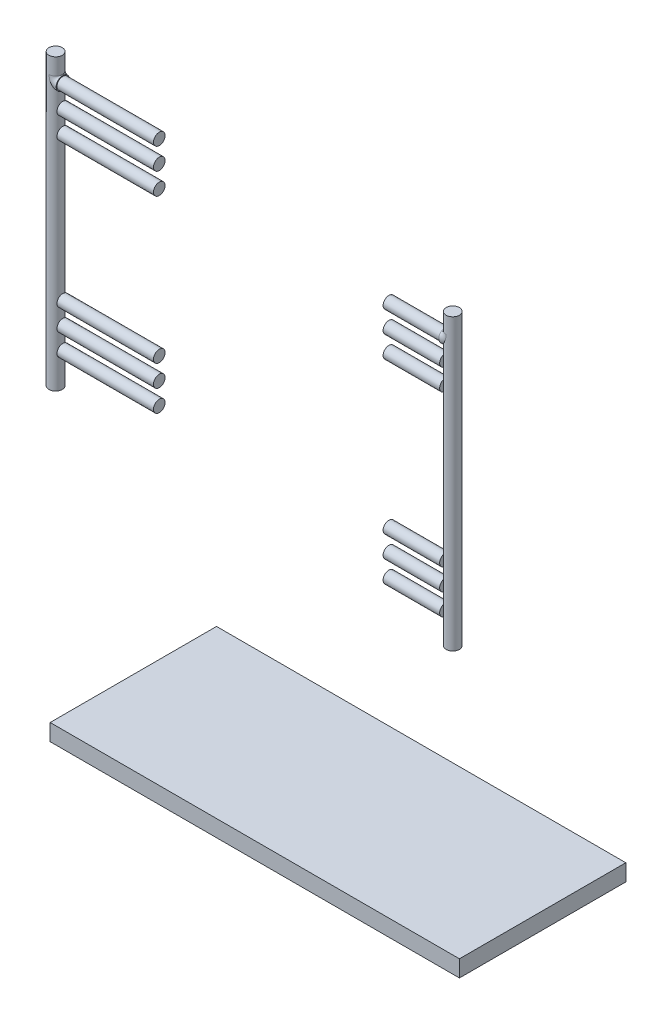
ISO-10303-21;
HEADER;
FILE_DESCRIPTION(('STEP AP214'),'2;1');
FILE_NAME('part.step','',(''),(''),'','','');
FILE_SCHEMA(('AUTOMOTIVE_DESIGN { 1 0 10303 214 1 1 1 1 }'));
ENDSEC;
DATA;
#1=APPLICATION_CONTEXT('core data for automotive mechanical design processes');
#2=APPLICATION_PROTOCOL_DEFINITION('international standard','automotive_design',2000,#1);
#3=PRODUCT_CONTEXT('',#1,'mechanical');
#4=PRODUCT('Part','Part','',(#3));
#5=PRODUCT_RELATED_PRODUCT_CATEGORY('part','',(#4));
#6=PRODUCT_DEFINITION_FORMATION('','',#4);
#7=PRODUCT_DEFINITION_CONTEXT('part definition',#1,'design');
#8=PRODUCT_DEFINITION('design','',#6,#7);
#9=PRODUCT_DEFINITION_SHAPE('','',#8);
#10=(LENGTH_UNIT() NAMED_UNIT(*) SI_UNIT(.MILLI.,.METRE.));
#11=(NAMED_UNIT(*) PLANE_ANGLE_UNIT() SI_UNIT($,.RADIAN.));
#12=(NAMED_UNIT(*) SI_UNIT($,.STERADIAN.) SOLID_ANGLE_UNIT());
#13=UNCERTAINTY_MEASURE_WITH_UNIT(LENGTH_MEASURE(1.E-05),#10,'distance_accuracy_value','');
#14=(GEOMETRIC_REPRESENTATION_CONTEXT(3) GLOBAL_UNCERTAINTY_ASSIGNED_CONTEXT((#13)) GLOBAL_UNIT_ASSIGNED_CONTEXT((#10,
#11,#12)) REPRESENTATION_CONTEXT('',''));
#15=CARTESIAN_POINT('',(0.,0.,0.));
#16=DIRECTION('',(0.,0.,1.));
#17=DIRECTION('',(1.,0.,0.));
#18=AXIS2_PLACEMENT_3D('',#15,#16,#17);
#19=CARTESIAN_POINT('',(901.951453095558,-1038.04854690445,0.));
#20=DIRECTION('',(-1.,0.,0.));
#21=DIRECTION('',(0.,-1.,0.));
#22=AXIS2_PLACEMENT_3D('',#19,#20,#21);
#23=PLANE('',#22);
#24=DIRECTION('',(0.,0.,1.));
#25=VECTOR('',#24,1.);
#26=CARTESIAN_POINT('',(901.951453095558,-988.048546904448,0.));
#27=LINE('',#26,#25);
#28=CARTESIAN_POINT('',(901.951453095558,-988.048546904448,-500.));
#29=VERTEX_POINT('',#28);
#30=CARTESIAN_POINT('',(901.951453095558,-988.048546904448,0.));
#31=VERTEX_POINT('',#30);
#32=EDGE_CURVE('E105',#29,#31,#27,.T.);
#33=ORIENTED_EDGE('',*,*,#32,.T.);
#34=DIRECTION('',(0.,1.,0.));
#35=VECTOR('',#34,1.);
#36=CARTESIAN_POINT('',(901.951453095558,-1038.04854690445,0.));
#37=LINE('',#36,#35);
#38=CARTESIAN_POINT('',(901.951453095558,-1038.04854690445,0.));
#39=VERTEX_POINT('',#38);
#40=EDGE_CURVE('E12',#39,#31,#37,.T.);
#41=ORIENTED_EDGE('',*,*,#40,.F.);
#42=DIRECTION('',(0.,0.,1.));
#43=VECTOR('',#42,1.);
#44=CARTESIAN_POINT('',(901.951453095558,-1038.04854690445,0.));
#45=LINE('',#44,#43);
#46=CARTESIAN_POINT('',(901.951453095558,-1038.04854690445,-500.));
#47=VERTEX_POINT('',#46);
#48=EDGE_CURVE('E93',#47,#39,#45,.T.);
#49=ORIENTED_EDGE('',*,*,#48,.F.);
#50=DIRECTION('',(0.,1.,0.));
#51=VECTOR('',#50,1.);
#52=CARTESIAN_POINT('',(901.951453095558,-1038.04854690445,-500.));
#53=LINE('',#52,#51);
#54=EDGE_CURVE('E101',#47,#29,#53,.T.);
#55=ORIENTED_EDGE('',*,*,#54,.T.);
#56=EDGE_LOOP('',(#33,#41,#49,#55));
#57=FACE_BOUND('',#56,.T.);
#58=ADVANCED_FACE('F42',(#57),#23,.F.);
#59=CARTESIAN_POINT('',(901.951453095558,-1038.04854690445,0.));
#60=DIRECTION('',(0.,0.,-1.));
#61=DIRECTION('',(-1.,0.,0.));
#62=AXIS2_PLACEMENT_3D('',#59,#60,#61);
#63=PLANE('',#62);
#64=DIRECTION('',(-1.,0.,0.));
#65=VECTOR('',#64,1.);
#66=CARTESIAN_POINT('',(901.951453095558,-988.048546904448,0.));
#67=LINE('',#66,#65);
#68=CARTESIAN_POINT('',(-328.048546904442,-988.048546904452,-1.50631556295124E-13));
#69=VERTEX_POINT('',#68);
#70=EDGE_CURVE('E97',#31,#69,#67,.T.);
#71=ORIENTED_EDGE('',*,*,#70,.T.);
#72=DIRECTION('',(0.,1.,0.));
#73=VECTOR('',#72,1.);
#74=CARTESIAN_POINT('',(-328.048546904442,-1038.04854690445,-1.50631556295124E-13));
#75=LINE('',#74,#73);
#76=CARTESIAN_POINT('',(-328.048546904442,-1038.04854690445,-1.50631556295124E-13));
#77=VERTEX_POINT('',#76);
#78=EDGE_CURVE('E50',#77,#69,#75,.T.);
#79=ORIENTED_EDGE('',*,*,#78,.F.);
#80=DIRECTION('',(-1.,0.,0.));
#81=VECTOR('',#80,1.);
#82=CARTESIAN_POINT('',(901.951453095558,-1038.04854690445,0.));
#83=LINE('',#82,#81);
#84=EDGE_CURVE('E88',#39,#77,#83,.T.);
#85=ORIENTED_EDGE('',*,*,#84,.F.);
#86=ORIENTED_EDGE('',*,*,#40,.T.);
#87=EDGE_LOOP('',(#71,#79,#85,#86));
#88=FACE_BOUND('',#87,.T.);
#89=ADVANCED_FACE('F96',(#88),#63,.F.);
#90=CARTESIAN_POINT('',(-328.048546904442,-1038.04854690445,-1.50631556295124E-13));
#91=DIRECTION('',(1.,0.,0.));
#92=DIRECTION('',(0.,1.,0.));
#93=AXIS2_PLACEMENT_3D('',#90,#91,#92);
#94=PLANE('',#93);
#95=DIRECTION('',(0.,0.,-1.));
#96=VECTOR('',#95,1.);
#97=CARTESIAN_POINT('',(-328.048546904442,-988.048546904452,-1.50631556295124E-13));
#98=LINE('',#97,#96);
#99=CARTESIAN_POINT('',(-328.048546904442,-988.048546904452,-500.));
#100=VERTEX_POINT('',#99);
#101=EDGE_CURVE('E75',#69,#100,#98,.T.);
#102=ORIENTED_EDGE('',*,*,#101,.T.);
#103=DIRECTION('',(0.,1.,0.));
#104=VECTOR('',#103,1.);
#105=CARTESIAN_POINT('',(-328.048546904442,-1038.04854690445,-500.));
#106=LINE('',#105,#104);
#107=CARTESIAN_POINT('',(-328.048546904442,-1038.04854690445,-500.));
#108=VERTEX_POINT('',#107);
#109=EDGE_CURVE('E98',#108,#100,#106,.T.);
#110=ORIENTED_EDGE('',*,*,#109,.F.);
#111=DIRECTION('',(0.,0.,-1.));
#112=VECTOR('',#111,1.);
#113=CARTESIAN_POINT('',(-328.048546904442,-1038.04854690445,-1.50631556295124E-13));
#114=LINE('',#113,#112);
#115=EDGE_CURVE('E91',#77,#108,#114,.T.);
#116=ORIENTED_EDGE('',*,*,#115,.F.);
#117=ORIENTED_EDGE('',*,*,#78,.T.);
#118=EDGE_LOOP('',(#102,#110,#116,#117));
#119=FACE_BOUND('',#118,.T.);
#120=ADVANCED_FACE('F99',(#119),#94,.F.);
#121=CARTESIAN_POINT('',(901.951453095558,-1038.04854690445,-500.));
#122=DIRECTION('',(0.,0.,1.));
#123=DIRECTION('',(1.,0.,0.));
#124=AXIS2_PLACEMENT_3D('',#121,#122,#123);
#125=PLANE('',#124);
#126=DIRECTION('',(1.,0.,0.));
#127=VECTOR('',#126,1.);
#128=CARTESIAN_POINT('',(901.951453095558,-988.048546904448,-500.));
#129=LINE('',#128,#127);
#130=EDGE_CURVE('E81',#100,#29,#129,.T.);
#131=ORIENTED_EDGE('',*,*,#130,.T.);
#132=ORIENTED_EDGE('',*,*,#54,.F.);
#133=DIRECTION('',(1.,0.,0.));
#134=VECTOR('',#133,1.);
#135=CARTESIAN_POINT('',(901.951453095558,-1038.04854690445,-500.));
#136=LINE('',#135,#134);
#137=EDGE_CURVE('E58',#108,#47,#136,.T.);
#138=ORIENTED_EDGE('',*,*,#137,.F.);
#139=ORIENTED_EDGE('',*,*,#109,.T.);
#140=EDGE_LOOP('',(#131,#132,#138,#139));
#141=FACE_BOUND('',#140,.T.);
#142=ADVANCED_FACE('F112',(#141),#125,.F.);
#143=CARTESIAN_POINT('',(3.62132641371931E-12,-1038.04854690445,0.));
#144=DIRECTION('',(0.,1.,0.));
#145=DIRECTION('',(-1.,0.,0.));
#146=AXIS2_PLACEMENT_3D('',#143,#144,#145);
#147=PLANE('',#146);
#148=ORIENTED_EDGE('',*,*,#48,.T.);
#149=ORIENTED_EDGE('',*,*,#84,.T.);
#150=ORIENTED_EDGE('',*,*,#115,.T.);
#151=ORIENTED_EDGE('',*,*,#137,.T.);
#152=EDGE_LOOP('',(#148,#149,#150,#151));
#153=FACE_BOUND('',#152,.T.);
#154=ADVANCED_FACE('F89',(#153),#147,.F.);
#155=CARTESIAN_POINT('',(3.44675234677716E-12,-988.048546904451,0.));
#156=DIRECTION('',(0.,1.,0.));
#157=DIRECTION('',(-1.,0.,0.));
#158=AXIS2_PLACEMENT_3D('',#155,#156,#157);
#159=PLANE('',#158);
#160=ORIENTED_EDGE('',*,*,#32,.F.);
#161=ORIENTED_EDGE('',*,*,#130,.F.);
#162=ORIENTED_EDGE('',*,*,#101,.F.);
#163=ORIENTED_EDGE('',*,*,#70,.F.);
#164=EDGE_LOOP('',(#160,#161,#162,#163));
#165=FACE_BOUND('',#164,.T.);
#166=ADVANCED_FACE('F115',(#165),#159,.T.);
#167=CLOSED_SHELL('',(#58,#89,#120,#142,#154,#166));
#168=MANIFOLD_SOLID_BREP('B2',#167);
#169=CARTESIAN_POINT('',(-311.667368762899,-103.332631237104,0.));
#170=DIRECTION('',(0.,1.,0.));
#171=DIRECTION('',(-1.,0.,0.));
#172=AXIS2_PLACEMENT_3D('',#169,#170,#171);
#173=CYLINDRICAL_SURFACE('',#172,20.);
#174=CARTESIAN_POINT('',(-311.667368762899,-103.332631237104,0.));
#175=DIRECTION('',(0.,1.,0.));
#176=DIRECTION('',(-1.,0.,0.));
#177=AXIS2_PLACEMENT_3D('',#174,#175,#176);
#178=CIRCLE('',#177,20.);
#179=CARTESIAN_POINT('',(-331.667368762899,-103.332631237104,0.));
#180=VERTEX_POINT('',#179);
#181=EDGE_CURVE('E41',#180,#180,#178,.T.);
#182=CARTESIAN_POINT('',(-311.667368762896,766.667368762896,0.));
#183=DIRECTION('',(0.,1.,0.));
#184=DIRECTION('',(-1.,0.,0.));
#185=AXIS2_PLACEMENT_3D('',#182,#183,#184);
#186=CIRCLE('',#185,20.);
#187=CARTESIAN_POINT('',(-331.667368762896,766.667368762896,0.));
#188=VERTEX_POINT('',#187);
#189=EDGE_CURVE('E182',#188,#188,#186,.T.);
#190=CARTESIAN_POINT('',(-331.667368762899,-103.332631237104,0.));
#191=CARTESIAN_POINT('',(-331.667368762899,-94.2701312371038,0.));
#192=CARTESIAN_POINT('',(-331.667368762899,-85.2076312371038,0.));
#193=CARTESIAN_POINT('',(-331.667368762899,-67.0826312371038,0.));
#194=CARTESIAN_POINT('',(-331.667368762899,-58.0201312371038,0.));
#195=CARTESIAN_POINT('',(-331.667368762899,-39.8951312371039,0.));
#196=CARTESIAN_POINT('',(-331.667368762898,-30.8326312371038,0.));
#197=CARTESIAN_POINT('',(-331.667368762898,-12.7076312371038,0.));
#198=CARTESIAN_POINT('',(-331.667368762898,-3.64513123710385,0.));
#199=CARTESIAN_POINT('',(-331.667368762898,14.4798687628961,0.));
#200=CARTESIAN_POINT('',(-331.667368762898,23.5423687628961,0.));
#201=CARTESIAN_POINT('',(-331.667368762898,41.6673687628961,0.));
#202=CARTESIAN_POINT('',(-331.667368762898,50.7298687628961,0.));
#203=CARTESIAN_POINT('',(-331.667368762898,68.8548687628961,0.));
#204=CARTESIAN_POINT('',(-331.667368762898,77.9173687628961,0.));
#205=CARTESIAN_POINT('',(-331.667368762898,96.0423687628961,0.));
#206=CARTESIAN_POINT('',(-331.667368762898,105.104868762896,0.));
#207=CARTESIAN_POINT('',(-331.667368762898,123.229868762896,0.));
#208=CARTESIAN_POINT('',(-331.667368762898,132.292368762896,0.));
#209=CARTESIAN_POINT('',(-331.667368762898,150.417368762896,0.));
#210=CARTESIAN_POINT('',(-331.667368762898,159.479868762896,0.));
#211=CARTESIAN_POINT('',(-331.667368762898,177.604868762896,0.));
#212=CARTESIAN_POINT('',(-331.667368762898,186.667368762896,0.));
#213=CARTESIAN_POINT('',(-331.667368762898,204.792368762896,0.));
#214=CARTESIAN_POINT('',(-331.667368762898,213.854868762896,0.));
#215=CARTESIAN_POINT('',(-331.667368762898,231.979868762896,0.));
#216=CARTESIAN_POINT('',(-331.667368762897,241.042368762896,0.));
#217=CARTESIAN_POINT('',(-331.667368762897,259.167368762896,0.));
#218=CARTESIAN_POINT('',(-331.667368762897,268.229868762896,0.));
#219=CARTESIAN_POINT('',(-331.667368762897,286.354868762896,0.));
#220=CARTESIAN_POINT('',(-331.667368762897,295.417368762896,0.));
#221=CARTESIAN_POINT('',(-331.667368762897,313.542368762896,0.));
#222=CARTESIAN_POINT('',(-331.667368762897,322.604868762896,0.));
#223=CARTESIAN_POINT('',(-331.667368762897,340.729868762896,0.));
#224=CARTESIAN_POINT('',(-331.667368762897,349.792368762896,0.));
#225=CARTESIAN_POINT('',(-331.667368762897,367.917368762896,0.));
#226=CARTESIAN_POINT('',(-331.667368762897,376.979868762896,0.));
#227=CARTESIAN_POINT('',(-331.667368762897,395.104868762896,0.));
#228=CARTESIAN_POINT('',(-331.667368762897,404.167368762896,0.));
#229=CARTESIAN_POINT('',(-331.667368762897,422.292368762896,0.));
#230=CARTESIAN_POINT('',(-331.667368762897,431.354868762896,0.));
#231=CARTESIAN_POINT('',(-331.667368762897,449.479868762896,0.));
#232=CARTESIAN_POINT('',(-331.667368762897,458.542368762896,0.));
#233=CARTESIAN_POINT('',(-331.667368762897,476.667368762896,0.));
#234=CARTESIAN_POINT('',(-331.667368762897,485.729868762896,0.));
#235=CARTESIAN_POINT('',(-331.667368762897,503.854868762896,0.));
#236=CARTESIAN_POINT('',(-331.667368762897,512.917368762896,0.));
#237=CARTESIAN_POINT('',(-331.667368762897,531.042368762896,0.));
#238=CARTESIAN_POINT('',(-331.667368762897,540.104868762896,0.));
#239=CARTESIAN_POINT('',(-331.667368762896,558.229868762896,0.));
#240=CARTESIAN_POINT('',(-331.667368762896,567.292368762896,0.));
#241=CARTESIAN_POINT('',(-331.667368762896,585.417368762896,0.));
#242=CARTESIAN_POINT('',(-331.667368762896,594.479868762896,0.));
#243=CARTESIAN_POINT('',(-331.667368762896,612.604868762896,0.));
#244=CARTESIAN_POINT('',(-331.667368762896,621.667368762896,0.));
#245=CARTESIAN_POINT('',(-331.667368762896,639.792368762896,0.));
#246=CARTESIAN_POINT('',(-331.667368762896,648.854868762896,0.));
#247=CARTESIAN_POINT('',(-331.667368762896,666.979868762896,0.));
#248=CARTESIAN_POINT('',(-331.667368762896,676.042368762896,0.));
#249=CARTESIAN_POINT('',(-331.667368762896,694.167368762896,0.));
#250=CARTESIAN_POINT('',(-331.667368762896,703.229868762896,0.));
#251=CARTESIAN_POINT('',(-331.667368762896,721.354868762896,0.));
#252=CARTESIAN_POINT('',(-331.667368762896,730.417368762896,0.));
#253=CARTESIAN_POINT('',(-331.667368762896,748.542368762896,0.));
#254=CARTESIAN_POINT('',(-331.667368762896,757.604868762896,0.));
#255=CARTESIAN_POINT('',(-331.667368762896,766.667368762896,0.));
#256=B_SPLINE_CURVE_WITH_KNOTS('',3,(#190,#191,#192,#193,#194,#195,#196,#197,#198,#199,#200,
#201,#202,#203,#204,#205,#206,#207,#208,#209,#210,#211,#212,#213,#214,#215,#216,#217,#218,#219,
#220,#221,#222,#223,#224,#225,#226,#227,#228,#229,#230,#231,#232,#233,#234,#235,#236,#237,#238,
#239,#240,#241,#242,#243,#244,#245,#246,#247,#248,#249,#250,#251,#252,#253,#254,#255),
.UNSPECIFIED.,.F.,.F.,(4,2,2,2,2,2,2,2,2,2,2,2,2,2,2,2,2,2,2,2,2,2,2,2,2,2,2,2,2,2,2,2,4),(0.,
27.1875,54.375,81.5625,108.75,135.9375,163.125,190.3125,217.5,244.6875,271.875,299.0625,326.25,
353.4375,380.625,407.8125,435.,462.1875,489.375,516.5625,543.75,570.9375,598.125,625.3125,652.5,
679.6875,706.875,734.0625,761.25,788.4375,815.625,842.8125,870.),.UNSPECIFIED.);
#257=EDGE_CURVE('BSEAM176',#180,#188,#256,.T.);
#258=ORIENTED_EDGE('',*,*,#181,.T.);
#259=ORIENTED_EDGE('',*,*,#189,.F.);
#260=ORIENTED_EDGE('',*,*,#257,.T.);
#261=ORIENTED_EDGE('',*,*,#257,.F.);
#262=EDGE_LOOP('',(#258,#260,#259,#261));
#263=FACE_BOUND('',#262,.T.);
#264=ADVANCED_FACE('F176',(#263),#173,.T.);
#265=CARTESIAN_POINT('',(-311.667368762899,-103.332631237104,0.));
#266=DIRECTION('',(0.,1.,0.));
#267=DIRECTION('',(-1.,0.,0.));
#268=AXIS2_PLACEMENT_3D('',#265,#266,#267);
#269=PLANE('',#268);
#270=ORIENTED_EDGE('',*,*,#181,.F.);
#271=EDGE_LOOP('',(#270));
#272=FACE_BOUND('',#271,.T.);
#273=ADVANCED_FACE('F191',(#272),#269,.F.);
#274=CARTESIAN_POINT('',(-311.667368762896,766.667368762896,0.));
#275=DIRECTION('',(0.,1.,0.));
#276=DIRECTION('',(-1.,0.,0.));
#277=AXIS2_PLACEMENT_3D('',#274,#275,#276);
#278=PLANE('',#277);
#279=ORIENTED_EDGE('',*,*,#189,.T.);
#280=EDGE_LOOP('',(#279));
#281=FACE_BOUND('',#280,.T.);
#282=ADVANCED_FACE('F188',(#281),#278,.T.);
#283=CLOSED_SHELL('',(#264,#273,#282));
#284=MANIFOLD_SOLID_BREP('B6',#283);
#285=CARTESIAN_POINT('',(860.,615.,0.));
#286=DIRECTION('',(-1.,0.,0.));
#287=DIRECTION('',(0.,0.,1.));
#288=AXIS2_PLACEMENT_3D('',#285,#286,#287);
#289=CYLINDRICAL_SURFACE('',#288,17.5);
#290=CARTESIAN_POINT('',(860.,615.,0.));
#291=DIRECTION('',(1.,0.,0.));
#292=DIRECTION('',(0.,0.,-1.));
#293=AXIS2_PLACEMENT_3D('',#290,#291,#292);
#294=CIRCLE('',#293,17.5);
#295=CARTESIAN_POINT('',(860.,615.,-17.5));
#296=VERTEX_POINT('',#295);
#297=EDGE_CURVE('E174',#296,#296,#294,.T.);
#298=ORIENTED_EDGE('',*,*,#297,.F.);
#299=EDGE_LOOP('',(#298));
#300=FACE_BOUND('',#299,.T.);
#301=CARTESIAN_POINT('',(690.,615.,0.));
#302=DIRECTION('',(1.,0.,0.));
#303=DIRECTION('',(0.,0.,-1.));
#304=AXIS2_PLACEMENT_3D('',#301,#302,#303);
#305=CIRCLE('',#304,17.5);
#306=CARTESIAN_POINT('',(690.,615.,-17.5));
#307=VERTEX_POINT('',#306);
#308=EDGE_CURVE('E228',#307,#307,#305,.T.);
#309=ORIENTED_EDGE('',*,*,#308,.T.);
#310=EDGE_LOOP('',(#309));
#311=FACE_BOUND('',#310,.T.);
#312=ADVANCED_FACE('F225',(#300,#311),#289,.T.);
#313=CARTESIAN_POINT('',(690.,615.,0.));
#314=DIRECTION('',(1.,0.,0.));
#315=DIRECTION('',(0.,0.,-1.));
#316=AXIS2_PLACEMENT_3D('',#313,#314,#315);
#317=PLANE('',#316);
#318=ORIENTED_EDGE('',*,*,#308,.F.);
#319=EDGE_LOOP('',(#318));
#320=FACE_BOUND('',#319,.T.);
#321=ADVANCED_FACE('F270',(#320),#317,.F.);
#322=CARTESIAN_POINT('',(860.,615.,0.));
#323=DIRECTION('',(1.,0.,0.));
#324=DIRECTION('',(0.,0.,-1.));
#325=AXIS2_PLACEMENT_3D('',#322,#323,#324);
#326=PLANE('',#325);
#327=CARTESIAN_POINT('',(860.,615.,0.));
#328=DIRECTION('',(1.,0.,0.));
#329=DIRECTION('',(0.,0.,-1.));
#330=AXIS2_PLACEMENT_3D('',#327,#328,#329);
#331=CIRCLE('',#330,20.);
#332=CARTESIAN_POINT('',(860.,615.,-20.));
#333=VERTEX_POINT('',#332);
#334=EDGE_CURVE('E244',#333,#333,#331,.T.);
#335=ORIENTED_EDGE('',*,*,#334,.F.);
#336=EDGE_LOOP('',(#335));
#337=FACE_BOUND('',#336,.T.);
#338=ORIENTED_EDGE('',*,*,#297,.T.);
#339=EDGE_LOOP('',(#338));
#340=FACE_BOUND('',#339,.T.);
#341=ADVANCED_FACE('F268',(#337,#340),#326,.F.);
#342=CARTESIAN_POINT('',(860.,636.951453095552,0.));
#343=DIRECTION('',(0.,0.,-1.));
#344=DIRECTION('',(-1.,0.,0.));
#345=AXIS2_PLACEMENT_3D('',#342,#343,#344);
#346=TOROIDAL_SURFACE('',#345,21.9514530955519,20.);
#347=CARTESIAN_POINT('',(881.951453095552,636.951453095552,0.));
#348=DIRECTION('',(0.,1.,0.));
#349=DIRECTION('',(0.,0.,-1.));
#350=AXIS2_PLACEMENT_3D('',#347,#348,#349);
#351=CIRCLE('',#350,20.);
#352=CARTESIAN_POINT('',(881.951453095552,636.951453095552,-20.));
#353=VERTEX_POINT('',#352);
#354=CARTESIAN_POINT('',(881.951453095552,636.951453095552,20.));
#355=VERTEX_POINT('',#354);
#356=EDGE_CURVE('E238',#353,#355,#351,.T.);
#357=ORIENTED_EDGE('',*,*,#356,.F.);
#358=CARTESIAN_POINT('',(881.951453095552,636.951453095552,-20.));
#359=CARTESIAN_POINT('',(881.951453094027,636.881609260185,-20.0000000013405));
#360=CARTESIAN_POINT('',(881.951286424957,636.81176567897,-20.0000000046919));
#361=CARTESIAN_POINT('',(881.950639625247,636.676240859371,-19.99999998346));
#362=CARTESIAN_POINT('',(881.95017876,636.610559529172,-19.9999999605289));
#363=CARTESIAN_POINT('',(881.947137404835,636.282148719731,-19.9999997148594));
#364=CARTESIAN_POINT('',(881.94234592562,636.019436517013,-19.9999990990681));
#365=CARTESIAN_POINT('',(881.926373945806,635.432487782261,-19.9999863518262));
#366=CARTESIAN_POINT('',(881.913957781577,635.108284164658,-19.9999715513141));
#367=CARTESIAN_POINT('',(881.884124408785,634.503909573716,-19.9998911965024));
#368=CARTESIAN_POINT('',(881.867606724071,634.223692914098,-19.9998327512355));
#369=CARTESIAN_POINT('',(881.810019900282,633.383162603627,-19.9995381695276));
#370=CARTESIAN_POINT('',(881.760929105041,632.823368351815,-19.9991827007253));
#371=CARTESIAN_POINT('',(881.671470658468,631.98534869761,-19.9980617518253));
#372=CARTESIAN_POINT('',(881.639008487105,631.706248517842,-19.9975900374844));
#373=CARTESIAN_POINT('',(881.568853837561,631.148681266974,-19.9963709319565));
#374=CARTESIAN_POINT('',(881.531160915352,630.870214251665,-19.995623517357));
#375=CARTESIAN_POINT('',(881.40941988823,630.029759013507,-19.9928206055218));
#376=CARTESIAN_POINT('',(881.317371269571,629.468911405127,-19.9902089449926));
#377=CARTESIAN_POINT('',(881.112605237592,628.350973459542,-19.9826628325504));
#378=CARTESIAN_POINT('',(880.999885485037,627.79388355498,-19.9777281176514));
#379=CARTESIAN_POINT('',(880.754341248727,626.683959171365,-19.9645198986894));
#380=CARTESIAN_POINT('',(880.621509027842,626.13112641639,-19.9562451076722));
#381=CARTESIAN_POINT('',(880.33647011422,625.030552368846,-19.9352001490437));
#382=CARTESIAN_POINT('',(880.184261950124,624.482811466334,-19.9224296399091));
#383=CARTESIAN_POINT('',(879.698826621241,622.845183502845,-19.8754097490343));
#384=CARTESIAN_POINT('',(879.337425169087,621.763742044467,-19.8324731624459));
#385=CARTESIAN_POINT('',(878.546741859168,619.628234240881,-19.7121191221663));
#386=CARTESIAN_POINT('',(878.117470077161,618.574163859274,-19.6347067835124));
#387=CARTESIAN_POINT('',(877.197547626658,616.494053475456,-19.4325195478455));
#388=CARTESIAN_POINT('',(876.706723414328,615.468103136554,-19.3076086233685));
#389=CARTESIAN_POINT('',(875.673604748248,613.451487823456,-18.9968323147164));
#390=CARTESIAN_POINT('',(875.131298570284,612.460830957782,-18.8109530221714));
#391=CARTESIAN_POINT('',(874.00741707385,610.52288929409,-18.3645588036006));
#392=CARTESIAN_POINT('',(873.425951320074,609.57549498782,-18.1042460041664));
#393=CARTESIAN_POINT('',(872.235272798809,607.728370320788,-17.4940831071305));
#394=CARTESIAN_POINT('',(871.626079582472,606.828607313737,-17.1442953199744));
#395=CARTESIAN_POINT('',(870.653533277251,605.450975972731,-16.508760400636));
#396=CARTESIAN_POINT('',(870.294092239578,604.954257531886,-16.2575620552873));
#397=CARTESIAN_POINT('',(869.574873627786,603.982201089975,-15.7169545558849));
#398=CARTESIAN_POINT('',(869.215096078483,603.506861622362,-15.4275480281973));
#399=CARTESIAN_POINT('',(868.499730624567,602.580624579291,-14.8079359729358));
#400=CARTESIAN_POINT('',(868.144140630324,602.129714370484,-14.4777518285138));
#401=CARTESIAN_POINT('',(867.442018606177,601.255463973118,-13.7740063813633));
#402=CARTESIAN_POINT('',(867.095484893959,600.832118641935,-13.4004532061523));
#403=CARTESIAN_POINT('',(866.482326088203,600.09513891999,-12.6839978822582));
#404=CARTESIAN_POINT('',(866.213114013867,599.776027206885,-12.3489407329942));
#405=CARTESIAN_POINT('',(865.687902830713,599.160861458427,-11.648539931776));
#406=CARTESIAN_POINT('',(865.431903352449,598.864806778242,-11.2831971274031));
#407=CARTESIAN_POINT('',(864.937237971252,598.298807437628,-10.522458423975));
#408=CARTESIAN_POINT('',(864.698555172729,598.028837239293,-10.1270926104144));
#409=CARTESIAN_POINT('',(864.242459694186,597.517738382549,-9.30654202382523));
#410=CARTESIAN_POINT('',(864.025042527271,597.276603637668,-8.88136357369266));
#411=CARTESIAN_POINT('',(863.655698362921,596.870204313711,-8.08812682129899));
#412=CARTESIAN_POINT('',(863.499259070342,596.699305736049,-7.72504664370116));
#413=CARTESIAN_POINT('',(863.205382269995,596.380041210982,-6.98172363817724));
#414=CARTESIAN_POINT('',(863.067940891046,596.231670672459,-6.601484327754));
#415=CARTESIAN_POINT('',(862.814351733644,595.959169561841,-5.82562088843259));
#416=CARTESIAN_POINT('',(862.698198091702,595.835032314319,-5.43000103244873));
#417=CARTESIAN_POINT('',(862.489251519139,595.612526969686,-4.62551594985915));
#418=CARTESIAN_POINT('',(862.396458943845,595.514159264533,-4.21665052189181));
#419=CARTESIAN_POINT('',(862.235618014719,595.344095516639,-3.38611060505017));
#420=CARTESIAN_POINT('',(862.16771200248,595.272552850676,-2.96437693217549));
#421=CARTESIAN_POINT('',(862.05882552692,595.158013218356,-2.11359213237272));
#422=CARTESIAN_POINT('',(862.017845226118,595.115016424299,-1.68454096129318));
#423=CARTESIAN_POINT('',(861.963726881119,595.058263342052,-0.822865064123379));
#424=CARTESIAN_POINT('',(861.950581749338,595.044499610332,-0.390241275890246));
#425=CARTESIAN_POINT('',(861.952413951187,595.046418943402,0.474862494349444));
#426=CARTESIAN_POINT('',(861.967389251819,595.062099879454,0.907342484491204));
#427=CARTESIAN_POINT('',(862.02244396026,595.119843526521,1.72859690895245));
#428=CARTESIAN_POINT('',(862.060078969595,595.159337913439,2.11772131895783));
#429=CARTESIAN_POINT('',(862.157532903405,595.261839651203,2.89001418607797));
#430=CARTESIAN_POINT('',(862.21735015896,595.324845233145,3.27318308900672));
#431=CARTESIAN_POINT('',(862.358116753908,595.473575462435,4.03109783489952));
#432=CARTESIAN_POINT('',(862.439065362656,595.55929932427,4.40584396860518));
#433=CARTESIAN_POINT('',(862.620752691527,595.75245831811,5.14478449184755));
#434=CARTESIAN_POINT('',(862.721492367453,595.859894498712,5.50897837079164));
#435=CARTESIAN_POINT('',(862.94453682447,596.098883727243,6.2358659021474));
#436=CARTESIAN_POINT('',(863.06740350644,596.231069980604,6.59817825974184));
#437=CARTESIAN_POINT('',(863.330623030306,596.515857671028,7.30807940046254));
#438=CARTESIAN_POINT('',(863.470975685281,596.668458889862,7.65566834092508));
#439=CARTESIAN_POINT('',(863.767281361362,596.992696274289,8.33506344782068));
#440=CARTESIAN_POINT('',(863.923238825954,597.164337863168,8.66686507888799));
#441=CARTESIAN_POINT('',(864.248799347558,597.525212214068,9.31382096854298));
#442=CARTESIAN_POINT('',(864.418405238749,597.714448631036,9.6289717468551));
#443=CARTESIAN_POINT('',(864.851520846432,598.201520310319,10.3856217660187));
#444=CARTESIAN_POINT('',(865.121833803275,598.50873675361,10.8172369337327));
#445=CARTESIAN_POINT('',(865.682153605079,599.154055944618,11.6429851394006));
#446=CARTESIAN_POINT('',(865.972167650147,599.492170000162,12.0371043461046));
#447=CARTESIAN_POINT('',(866.567213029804,600.196184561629,12.7888753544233));
#448=CARTESIAN_POINT('',(866.872268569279,600.562130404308,13.1464653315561));
#449=CARTESIAN_POINT('',(867.492343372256,601.318085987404,13.8255418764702));
#450=CARTESIAN_POINT('',(867.807362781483,601.708096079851,14.147027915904));
#451=CARTESIAN_POINT('',(868.579555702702,602.681095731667,14.8858146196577));
#452=CARTESIAN_POINT('',(869.039858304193,603.27522987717,15.2852239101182));
#453=CARTESIAN_POINT('',(869.962711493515,604.500612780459,16.01930048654));
#454=CARTESIAN_POINT('',(870.425262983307,605.131877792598,16.3539391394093));
#455=CARTESIAN_POINT('',(871.344935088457,606.427136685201,16.9648728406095));
#456=CARTESIAN_POINT('',(871.802047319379,607.091174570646,17.2410866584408));
#457=CARTESIAN_POINT('',(872.703277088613,608.447008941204,17.7408203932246));
#458=CARTESIAN_POINT('',(873.147395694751,609.138803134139,17.9643446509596));
#459=CARTESIAN_POINT('',(874.111814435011,610.70071441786,18.4086991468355));
#460=CARTESIAN_POINT('',(874.627598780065,611.576811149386,18.6183047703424));
#461=CARTESIAN_POINT('',(875.62265019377,613.361155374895,18.9796333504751));
#462=CARTESIAN_POINT('',(876.101908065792,614.269410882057,19.1313417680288));
#463=CARTESIAN_POINT('',(877.015891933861,616.113499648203,19.3872444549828));
#464=CARTESIAN_POINT('',(877.450656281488,617.049308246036,19.4914799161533));
#465=CARTESIAN_POINT('',(878.269420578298,618.945815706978,19.6625914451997));
#466=CARTESIAN_POINT('',(878.653434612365,619.906507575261,19.7294778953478));
#467=CARTESIAN_POINT('',(879.379153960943,621.888806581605,19.8374222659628));
#468=CARTESIAN_POINT('',(879.718572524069,622.911317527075,19.8773485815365));
#469=CARTESIAN_POINT('',(880.177382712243,624.459846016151,19.921750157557));
#470=CARTESIAN_POINT('',(880.321898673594,624.978330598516,19.933968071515));
#471=CARTESIAN_POINT('',(880.593598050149,626.019907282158,19.9543182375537));
#472=CARTESIAN_POINT('',(880.720781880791,626.54299927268,19.9624505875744));
#473=CARTESIAN_POINT('',(880.984666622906,627.71521404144,19.9771532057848));
#474=CARTESIAN_POINT('',(881.116720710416,628.365399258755,19.9829223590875));
#475=CARTESIAN_POINT('',(881.352614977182,629.670823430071,19.991380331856));
#476=CARTESIAN_POINT('',(881.456457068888,630.326062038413,19.9940693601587));
#477=CARTESIAN_POINT('',(881.65726813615,631.803327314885,19.9981518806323));
#478=CARTESIAN_POINT('',(881.746167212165,632.626475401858,19.9990596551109));
#479=CARTESIAN_POINT('',(881.852025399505,633.954223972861,19.9997899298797));
#480=CARTESIAN_POINT('',(881.883520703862,634.457710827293,19.999897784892));
#481=CARTESIAN_POINT('',(881.919805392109,635.258269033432,19.9999794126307));
#482=CARTESIAN_POINT('',(881.930250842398,635.555088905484,19.9999900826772));
#483=CARTESIAN_POINT('',(881.945113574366,636.148577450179,20.0000004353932));
#484=CARTESIAN_POINT('',(881.949537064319,636.445245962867,20.0000001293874));
#485=CARTESIAN_POINT('',(881.951286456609,636.81176612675,19.9999999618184));
#486=CARTESIAN_POINT('',(881.951453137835,636.881609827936,19.999999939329));
#487=CARTESIAN_POINT('',(881.951453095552,636.951453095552,20.));
#488=B_SPLINE_CURVE_WITH_KNOTS('',3,(#358,#359,#360,#361,#362,#363,#364,#365,#366,#367,#368,
#369,#370,#371,#372,#373,#374,#375,#376,#377,#378,#379,#380,#381,#382,#383,#384,#385,#386,#387,
#388,#389,#390,#391,#392,#393,#394,#395,#396,#397,#398,#399,#400,#401,#402,#403,#404,#405,#406,
#407,#408,#409,#410,#411,#412,#413,#414,#415,#416,#417,#418,#419,#420,#421,#422,#423,#424,#425,
#426,#427,#428,#429,#430,#431,#432,#433,#434,#435,#436,#437,#438,#439,#440,#441,#442,#443,#444,
#445,#446,#447,#448,#449,#450,#451,#452,#453,#454,#455,#456,#457,#458,#459,#460,#461,#462,#463,
#464,#465,#466,#467,#468,#469,#470,#471,#472,#473,#474,#475,#476,#477,#478,#479,#480,#481,#482,
#483,#484,#485,#486,#487),.UNSPECIFIED.,.F.,.F.,(4,2,2,2,2,2,2,2,2,2,2,2,2,2,2,2,2,2,2,2,2,2,2,
2,2,2,2,2,2,2,2,2,2,2,2,2,2,2,2,2,2,2,2,2,2,2,2,2,2,2,2,2,2,2,2,2,2,2,2,2,2,2,2,2,4),(0.,
0.20953080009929,0.406579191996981,1.19480251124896,2.1680398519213,3.01011179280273,
4.69545467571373,5.53836191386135,6.38134074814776,8.08597656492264,9.79080540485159,
11.4962917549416,13.2019076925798,16.6218827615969,20.0413505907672,23.4706858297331,
26.9008039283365,30.3216944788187,33.7402091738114,35.7267732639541,37.7132008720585,
39.6985912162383,41.683610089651,43.2882218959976,44.8927888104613,46.4957685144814,
48.0984092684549,49.3892862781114,50.679899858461,51.9701574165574,53.2604345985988,
54.5579805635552,55.8555343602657,57.1527577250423,58.4498873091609,59.6273053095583,
60.8046347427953,61.9819234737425,63.1592690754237,64.3723618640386,65.5854416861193,
66.7988679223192,68.0125467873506,69.7941522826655,71.5764124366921,73.3616406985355,
75.1468950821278,77.6963272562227,80.2468838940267,82.8009637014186,85.3548330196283,
88.4658167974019,91.5775812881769,94.6866405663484,97.7948351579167,101.026504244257,
102.641405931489,104.256268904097,106.246081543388,108.235759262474,110.718149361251,
112.231285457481,113.122240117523,114.012275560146,114.221806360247),.UNSPECIFIED.);
#489=EDGE_CURVE('E240',#353,#355,#488,.T.);
#490=ORIENTED_EDGE('',*,*,#489,.T.);
#491=EDGE_LOOP('',(#357,#490));
#492=FACE_BOUND('',#491,.T.);
#493=ORIENTED_EDGE('',*,*,#334,.T.);
#494=EDGE_LOOP('',(#493));
#495=FACE_BOUND('',#494,.T.);
#496=ADVANCED_FACE('F241',(#492,#495),#346,.T.);
#497=CARTESIAN_POINT('',(881.951453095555,-183.048546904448,0.));
#498=DIRECTION('',(0.,1.,0.));
#499=DIRECTION('',(-1.,0.,0.));
#500=AXIS2_PLACEMENT_3D('',#497,#498,#499);
#501=CYLINDRICAL_SURFACE('',#500,20.);
#502=CARTESIAN_POINT('',(881.951453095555,-183.048546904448,0.));
#503=DIRECTION('',(0.,1.,0.));
#504=DIRECTION('',(-1.,0.,0.));
#505=AXIS2_PLACEMENT_3D('',#502,#503,#504);
#506=CIRCLE('',#505,20.);
#507=CARTESIAN_POINT('',(861.951453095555,-183.048546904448,0.));
#508=VERTEX_POINT('',#507);
#509=EDGE_CURVE('E245',#508,#508,#506,.T.);
#510=ORIENTED_EDGE('',*,*,#509,.T.);
#511=EDGE_LOOP('',(#510));
#512=FACE_BOUND('',#511,.T.);
#513=ORIENTED_EDGE('',*,*,#489,.F.);
#514=ORIENTED_EDGE('',*,*,#356,.T.);
#515=EDGE_LOOP('',(#513,#514));
#516=FACE_BOUND('',#515,.T.);
#517=CARTESIAN_POINT('',(881.951453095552,686.951453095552,0.));
#518=DIRECTION('',(0.,1.,0.));
#519=DIRECTION('',(-1.,0.,0.));
#520=AXIS2_PLACEMENT_3D('',#517,#518,#519);
#521=CIRCLE('',#520,20.);
#522=CARTESIAN_POINT('',(861.951453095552,686.951453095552,0.));
#523=VERTEX_POINT('',#522);
#524=EDGE_CURVE('E329',#523,#523,#521,.T.);
#525=ORIENTED_EDGE('',*,*,#524,.F.);
#526=EDGE_LOOP('',(#525));
#527=FACE_BOUND('',#526,.T.);
#528=ADVANCED_FACE('F247',(#512,#516,#527),#501,.T.);
#529=CARTESIAN_POINT('',(881.951453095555,-183.048546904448,0.));
#530=DIRECTION('',(0.,1.,0.));
#531=DIRECTION('',(-1.,0.,0.));
#532=AXIS2_PLACEMENT_3D('',#529,#530,#531);
#533=PLANE('',#532);
#534=ORIENTED_EDGE('',*,*,#509,.F.);
#535=EDGE_LOOP('',(#534));
#536=FACE_BOUND('',#535,.T.);
#537=ADVANCED_FACE('F265',(#536),#533,.F.);
#538=CARTESIAN_POINT('',(881.951453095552,686.951453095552,0.));
#539=DIRECTION('',(0.,1.,0.));
#540=DIRECTION('',(-1.,0.,0.));
#541=AXIS2_PLACEMENT_3D('',#538,#539,#540);
#542=PLANE('',#541);
#543=ORIENTED_EDGE('',*,*,#524,.T.);
#544=EDGE_LOOP('',(#543));
#545=FACE_BOUND('',#544,.T.);
#546=ADVANCED_FACE('F315',(#545),#542,.T.);
#547=CLOSED_SHELL('',(#312,#321,#341,#496,#528,#537,#546));
#548=MANIFOLD_SOLID_BREP('B36',#547);
#549=CARTESIAN_POINT('',(860.,550.,0.));
#550=DIRECTION('',(-1.,0.,0.));
#551=DIRECTION('',(0.,0.,1.));
#552=AXIS2_PLACEMENT_3D('',#549,#550,#551);
#553=CYLINDRICAL_SURFACE('',#552,17.5);
#554=CARTESIAN_POINT('',(860.,550.,0.));
#555=DIRECTION('',(1.,0.,0.));
#556=DIRECTION('',(0.,0.,-1.));
#557=AXIS2_PLACEMENT_3D('',#554,#555,#556);
#558=CIRCLE('',#557,17.5);
#559=CARTESIAN_POINT('',(860.,550.,-17.5));
#560=VERTEX_POINT('',#559);
#561=EDGE_CURVE('E224',#560,#560,#558,.T.);
#562=ORIENTED_EDGE('',*,*,#561,.F.);
#563=EDGE_LOOP('',(#562));
#564=FACE_BOUND('',#563,.T.);
#565=CARTESIAN_POINT('',(690.,550.,0.));
#566=DIRECTION('',(1.,0.,0.));
#567=DIRECTION('',(0.,0.,-1.));
#568=AXIS2_PLACEMENT_3D('',#565,#566,#567);
#569=CIRCLE('',#568,17.5);
#570=CARTESIAN_POINT('',(690.,550.,-17.5));
#571=VERTEX_POINT('',#570);
#572=EDGE_CURVE('E348',#571,#571,#569,.T.);
#573=ORIENTED_EDGE('',*,*,#572,.T.);
#574=EDGE_LOOP('',(#573));
#575=FACE_BOUND('',#574,.T.);
#576=ADVANCED_FACE('F345',(#564,#575),#553,.T.);
#577=CARTESIAN_POINT('',(860.,550.,0.));
#578=DIRECTION('',(1.,0.,0.));
#579=DIRECTION('',(0.,0.,-1.));
#580=AXIS2_PLACEMENT_3D('',#577,#578,#579);
#581=PLANE('',#580);
#582=ORIENTED_EDGE('',*,*,#561,.T.);
#583=EDGE_LOOP('',(#582));
#584=FACE_BOUND('',#583,.T.);
#585=ADVANCED_FACE('F360',(#584),#581,.T.);
#586=CARTESIAN_POINT('',(690.,550.,0.));
#587=DIRECTION('',(1.,0.,0.));
#588=DIRECTION('',(0.,0.,-1.));
#589=AXIS2_PLACEMENT_3D('',#586,#587,#588);
#590=PLANE('',#589);
#591=ORIENTED_EDGE('',*,*,#572,.F.);
#592=EDGE_LOOP('',(#591));
#593=FACE_BOUND('',#592,.T.);
#594=ADVANCED_FACE('F358',(#593),#590,.F.);
#595=CLOSED_SHELL('',(#576,#585,#594));
#596=MANIFOLD_SOLID_BREP('B168',#595);
#597=CARTESIAN_POINT('',(860.,485.,0.));
#598=DIRECTION('',(-1.,0.,0.));
#599=DIRECTION('',(0.,0.,1.));
#600=AXIS2_PLACEMENT_3D('',#597,#598,#599);
#601=CYLINDRICAL_SURFACE('',#600,17.5);
#602=CARTESIAN_POINT('',(860.,485.,0.));
#603=DIRECTION('',(1.,0.,0.));
#604=DIRECTION('',(0.,0.,-1.));
#605=AXIS2_PLACEMENT_3D('',#602,#603,#604);
#606=CIRCLE('',#605,17.5);
#607=CARTESIAN_POINT('',(860.,485.,-17.5));
#608=VERTEX_POINT('',#607);
#609=EDGE_CURVE('E344',#608,#608,#606,.T.);
#610=ORIENTED_EDGE('',*,*,#609,.F.);
#611=EDGE_LOOP('',(#610));
#612=FACE_BOUND('',#611,.T.);
#613=CARTESIAN_POINT('',(690.,485.,0.));
#614=DIRECTION('',(1.,0.,0.));
#615=DIRECTION('',(0.,0.,-1.));
#616=AXIS2_PLACEMENT_3D('',#613,#614,#615);
#617=CIRCLE('',#616,17.5);
#618=CARTESIAN_POINT('',(690.,485.,-17.5));
#619=VERTEX_POINT('',#618);
#620=EDGE_CURVE('E397',#619,#619,#617,.T.);
#621=ORIENTED_EDGE('',*,*,#620,.T.);
#622=EDGE_LOOP('',(#621));
#623=FACE_BOUND('',#622,.T.);
#624=ADVANCED_FACE('F394',(#612,#623),#601,.T.);
#625=CARTESIAN_POINT('',(860.,485.,0.));
#626=DIRECTION('',(1.,0.,0.));
#627=DIRECTION('',(0.,0.,-1.));
#628=AXIS2_PLACEMENT_3D('',#625,#626,#627);
#629=PLANE('',#628);
#630=ORIENTED_EDGE('',*,*,#609,.T.);
#631=EDGE_LOOP('',(#630));
#632=FACE_BOUND('',#631,.T.);
#633=ADVANCED_FACE('F409',(#632),#629,.T.);
#634=CARTESIAN_POINT('',(690.,485.,0.));
#635=DIRECTION('',(1.,0.,0.));
#636=DIRECTION('',(0.,0.,-1.));
#637=AXIS2_PLACEMENT_3D('',#634,#635,#636);
#638=PLANE('',#637);
#639=ORIENTED_EDGE('',*,*,#620,.F.);
#640=EDGE_LOOP('',(#639));
#641=FACE_BOUND('',#640,.T.);
#642=ADVANCED_FACE('F407',(#641),#638,.F.);
#643=CLOSED_SHELL('',(#624,#633,#642));
#644=MANIFOLD_SOLID_BREP('B219',#643);
#645=CARTESIAN_POINT('',(860.,30.,0.));
#646=DIRECTION('',(-1.,0.,0.));
#647=DIRECTION('',(0.,0.,1.));
#648=AXIS2_PLACEMENT_3D('',#645,#646,#647);
#649=CYLINDRICAL_SURFACE('',#648,17.5);
#650=CARTESIAN_POINT('',(860.,30.,0.));
#651=DIRECTION('',(1.,0.,0.));
#652=DIRECTION('',(0.,0.,-1.));
#653=AXIS2_PLACEMENT_3D('',#650,#651,#652);
#654=CIRCLE('',#653,17.5);
#655=CARTESIAN_POINT('',(860.,30.,-17.5));
#656=VERTEX_POINT('',#655);
#657=EDGE_CURVE('E393',#656,#656,#654,.T.);
#658=ORIENTED_EDGE('',*,*,#657,.F.);
#659=EDGE_LOOP('',(#658));
#660=FACE_BOUND('',#659,.T.);
#661=CARTESIAN_POINT('',(690.,30.,0.));
#662=DIRECTION('',(1.,0.,0.));
#663=DIRECTION('',(0.,0.,-1.));
#664=AXIS2_PLACEMENT_3D('',#661,#662,#663);
#665=CIRCLE('',#664,17.5);
#666=CARTESIAN_POINT('',(690.,30.,-17.5));
#667=VERTEX_POINT('',#666);
#668=EDGE_CURVE('E446',#667,#667,#665,.T.);
#669=ORIENTED_EDGE('',*,*,#668,.T.);
#670=EDGE_LOOP('',(#669));
#671=FACE_BOUND('',#670,.T.);
#672=ADVANCED_FACE('F443',(#660,#671),#649,.T.);
#673=CARTESIAN_POINT('',(860.,30.,0.));
#674=DIRECTION('',(1.,0.,0.));
#675=DIRECTION('',(0.,0.,-1.));
#676=AXIS2_PLACEMENT_3D('',#673,#674,#675);
#677=PLANE('',#676);
#678=ORIENTED_EDGE('',*,*,#657,.T.);
#679=EDGE_LOOP('',(#678));
#680=FACE_BOUND('',#679,.T.);
#681=ADVANCED_FACE('F458',(#680),#677,.T.);
#682=CARTESIAN_POINT('',(690.,30.,0.));
#683=DIRECTION('',(1.,0.,0.));
#684=DIRECTION('',(0.,0.,-1.));
#685=AXIS2_PLACEMENT_3D('',#682,#683,#684);
#686=PLANE('',#685);
#687=ORIENTED_EDGE('',*,*,#668,.F.);
#688=EDGE_LOOP('',(#687));
#689=FACE_BOUND('',#688,.T.);
#690=ADVANCED_FACE('F456',(#689),#686,.F.);
#691=CLOSED_SHELL('',(#672,#681,#690));
#692=MANIFOLD_SOLID_BREP('B339',#691);
#693=CARTESIAN_POINT('',(860.,-35.,0.));
#694=DIRECTION('',(-1.,0.,0.));
#695=DIRECTION('',(0.,0.,1.));
#696=AXIS2_PLACEMENT_3D('',#693,#694,#695);
#697=CYLINDRICAL_SURFACE('',#696,17.5);
#698=CARTESIAN_POINT('',(860.,-35.,0.));
#699=DIRECTION('',(1.,0.,0.));
#700=DIRECTION('',(0.,0.,-1.));
#701=AXIS2_PLACEMENT_3D('',#698,#699,#700);
#702=CIRCLE('',#701,17.5);
#703=CARTESIAN_POINT('',(860.,-35.,-17.5));
#704=VERTEX_POINT('',#703);
#705=EDGE_CURVE('E442',#704,#704,#702,.T.);
#706=ORIENTED_EDGE('',*,*,#705,.F.);
#707=EDGE_LOOP('',(#706));
#708=FACE_BOUND('',#707,.T.);
#709=CARTESIAN_POINT('',(690.,-35.,0.));
#710=DIRECTION('',(1.,0.,0.));
#711=DIRECTION('',(0.,0.,-1.));
#712=AXIS2_PLACEMENT_3D('',#709,#710,#711);
#713=CIRCLE('',#712,17.5);
#714=CARTESIAN_POINT('',(690.,-35.,-17.5));
#715=VERTEX_POINT('',#714);
#716=EDGE_CURVE('E495',#715,#715,#713,.T.);
#717=ORIENTED_EDGE('',*,*,#716,.T.);
#718=EDGE_LOOP('',(#717));
#719=FACE_BOUND('',#718,.T.);
#720=ADVANCED_FACE('F492',(#708,#719),#697,.T.);
#721=CARTESIAN_POINT('',(860.,-35.,0.));
#722=DIRECTION('',(1.,0.,0.));
#723=DIRECTION('',(0.,0.,-1.));
#724=AXIS2_PLACEMENT_3D('',#721,#722,#723);
#725=PLANE('',#724);
#726=ORIENTED_EDGE('',*,*,#705,.T.);
#727=EDGE_LOOP('',(#726));
#728=FACE_BOUND('',#727,.T.);
#729=ADVANCED_FACE('F507',(#728),#725,.T.);
#730=CARTESIAN_POINT('',(690.,-35.,0.));
#731=DIRECTION('',(1.,0.,0.));
#732=DIRECTION('',(0.,0.,-1.));
#733=AXIS2_PLACEMENT_3D('',#730,#731,#732);
#734=PLANE('',#733);
#735=ORIENTED_EDGE('',*,*,#716,.F.);
#736=EDGE_LOOP('',(#735));
#737=FACE_BOUND('',#736,.T.);
#738=ADVANCED_FACE('F505',(#737),#734,.F.);
#739=CLOSED_SHELL('',(#720,#729,#738));
#740=MANIFOLD_SOLID_BREP('B388',#739);
#741=CARTESIAN_POINT('',(860.,-100.,0.));
#742=DIRECTION('',(-1.,0.,0.));
#743=DIRECTION('',(0.,0.,1.));
#744=AXIS2_PLACEMENT_3D('',#741,#742,#743);
#745=CYLINDRICAL_SURFACE('',#744,17.5);
#746=CARTESIAN_POINT('',(860.,-100.,0.));
#747=DIRECTION('',(1.,0.,0.));
#748=DIRECTION('',(0.,0.,-1.));
#749=AXIS2_PLACEMENT_3D('',#746,#747,#748);
#750=CIRCLE('',#749,17.5);
#751=CARTESIAN_POINT('',(860.,-100.,-17.5));
#752=VERTEX_POINT('',#751);
#753=EDGE_CURVE('E491',#752,#752,#750,.T.);
#754=ORIENTED_EDGE('',*,*,#753,.F.);
#755=EDGE_LOOP('',(#754));
#756=FACE_BOUND('',#755,.T.);
#757=CARTESIAN_POINT('',(690.,-100.,0.));
#758=DIRECTION('',(1.,0.,0.));
#759=DIRECTION('',(0.,0.,-1.));
#760=AXIS2_PLACEMENT_3D('',#757,#758,#759);
#761=CIRCLE('',#760,17.5);
#762=CARTESIAN_POINT('',(690.,-100.,-17.5));
#763=VERTEX_POINT('',#762);
#764=EDGE_CURVE('E544',#763,#763,#761,.T.);
#765=ORIENTED_EDGE('',*,*,#764,.T.);
#766=EDGE_LOOP('',(#765));
#767=FACE_BOUND('',#766,.T.);
#768=ADVANCED_FACE('F541',(#756,#767),#745,.T.);
#769=CARTESIAN_POINT('',(860.,-100.,0.));
#770=DIRECTION('',(1.,0.,0.));
#771=DIRECTION('',(0.,0.,-1.));
#772=AXIS2_PLACEMENT_3D('',#769,#770,#771);
#773=PLANE('',#772);
#774=ORIENTED_EDGE('',*,*,#753,.T.);
#775=EDGE_LOOP('',(#774));
#776=FACE_BOUND('',#775,.T.);
#777=ADVANCED_FACE('F556',(#776),#773,.T.);
#778=CARTESIAN_POINT('',(690.,-100.,0.));
#779=DIRECTION('',(1.,0.,0.));
#780=DIRECTION('',(0.,0.,-1.));
#781=AXIS2_PLACEMENT_3D('',#778,#779,#780);
#782=PLANE('',#781);
#783=ORIENTED_EDGE('',*,*,#764,.F.);
#784=EDGE_LOOP('',(#783));
#785=FACE_BOUND('',#784,.T.);
#786=ADVANCED_FACE('F554',(#785),#782,.F.);
#787=CLOSED_SHELL('',(#768,#777,#786));
#788=MANIFOLD_SOLID_BREP('B437',#787);
#789=CARTESIAN_POINT('',(-290.,695.,0.));
#790=DIRECTION('',(1.,0.,0.));
#791=DIRECTION('',(0.,0.,-1.));
#792=AXIS2_PLACEMENT_3D('',#789,#790,#791);
#793=CYLINDRICAL_SURFACE('',#792,17.5);
#794=CARTESIAN_POINT('',(-290.,695.,0.));
#795=DIRECTION('',(-1.,0.,0.));
#796=DIRECTION('',(0.,0.,1.));
#797=AXIS2_PLACEMENT_3D('',#794,#795,#796);
#798=CIRCLE('',#797,17.5);
#799=CARTESIAN_POINT('',(-290.,695.,17.5));
#800=VERTEX_POINT('',#799);
#801=EDGE_CURVE('E596',#800,#800,#798,.F.);
#802=ORIENTED_EDGE('',*,*,#801,.T.);
#803=EDGE_LOOP('',(#802));
#804=FACE_BOUND('',#803,.T.);
#805=CARTESIAN_POINT('',(0.,695.,0.));
#806=DIRECTION('',(1.,0.,0.));
#807=DIRECTION('',(0.,0.,-1.));
#808=AXIS2_PLACEMENT_3D('',#805,#806,#807);
#809=CIRCLE('',#808,17.5);
#810=CARTESIAN_POINT('',(0.,695.,-17.5));
#811=VERTEX_POINT('',#810);
#812=EDGE_CURVE('E540',#811,#811,#809,.T.);
#813=ORIENTED_EDGE('',*,*,#812,.F.);
#814=EDGE_LOOP('',(#813));
#815=FACE_BOUND('',#814,.T.);
#816=ADVANCED_FACE('F590',(#804,#815),#793,.T.);
#817=CARTESIAN_POINT('',(0.,695.,0.));
#818=DIRECTION('',(1.,0.,0.));
#819=DIRECTION('',(0.,0.,-1.));
#820=AXIS2_PLACEMENT_3D('',#817,#818,#819);
#821=PLANE('',#820);
#822=ORIENTED_EDGE('',*,*,#812,.T.);
#823=EDGE_LOOP('',(#822));
#824=FACE_BOUND('',#823,.T.);
#825=ADVANCED_FACE('F623',(#824),#821,.T.);
#826=CARTESIAN_POINT('',(-290.,716.667368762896,0.));
#827=DIRECTION('',(0.,0.,1.));
#828=DIRECTION('',(1.,0.,0.));
#829=AXIS2_PLACEMENT_3D('',#826,#827,#828);
#830=TOROIDAL_SURFACE('',#829,21.6673687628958,20.);
#831=CARTESIAN_POINT('',(-311.667368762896,716.667368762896,0.));
#832=DIRECTION('',(0.,1.,0.));
#833=DIRECTION('',(0.,0.,1.));
#834=AXIS2_PLACEMENT_3D('',#831,#832,#833);
#835=CIRCLE('',#834,20.);
#836=CARTESIAN_POINT('',(-331.667368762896,716.667368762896,0.));
#837=VERTEX_POINT('',#836);
#838=EDGE_CURVE('E600',#837,#837,#835,.T.);
#839=CARTESIAN_POINT('',(-290.,695.,0.));
#840=DIRECTION('',(-1.,0.,0.));
#841=DIRECTION('',(0.,0.,1.));
#842=AXIS2_PLACEMENT_3D('',#839,#840,#841);
#843=CIRCLE('',#842,20.);
#844=CARTESIAN_POINT('',(-290.,675.,0.));
#845=VERTEX_POINT('',#844);
#846=EDGE_CURVE('E604',#845,#845,#843,.T.);
#847=CARTESIAN_POINT('',(-290.,716.667368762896,0.));
#848=DIRECTION('',(0.,0.,1.));
#849=DIRECTION('',(1.,0.,0.));
#850=AXIS2_PLACEMENT_3D('',#847,#848,#849);
#851=CIRCLE('',#850,41.6673687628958);
#852=EDGE_CURVE('',#837,#845,#851,.T.);
#853=ORIENTED_EDGE('',*,*,#838,.F.);
#854=ORIENTED_EDGE('',*,*,#846,.T.);
#855=ORIENTED_EDGE('',*,*,#852,.T.);
#856=ORIENTED_EDGE('',*,*,#852,.F.);
#857=EDGE_LOOP('',(#853,#855,#854,#856));
#858=FACE_BOUND('',#857,.T.);
#859=ADVANCED_FACE('F610',(#858),#830,.T.);
#860=CARTESIAN_POINT('',(-311.667368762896,716.667368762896,0.));
#861=DIRECTION('',(0.,1.,0.));
#862=DIRECTION('',(0.,0.,1.));
#863=AXIS2_PLACEMENT_3D('',#860,#861,#862);
#864=PLANE('',#863);
#865=ORIENTED_EDGE('',*,*,#838,.T.);
#866=EDGE_LOOP('',(#865));
#867=FACE_BOUND('',#866,.T.);
#868=ADVANCED_FACE('F614',(#867),#864,.T.);
#869=CARTESIAN_POINT('',(-290.,695.,0.));
#870=DIRECTION('',(-1.,0.,0.));
#871=DIRECTION('',(0.,0.,1.));
#872=AXIS2_PLACEMENT_3D('',#869,#870,#871);
#873=PLANE('',#872);
#874=ORIENTED_EDGE('',*,*,#801,.F.);
#875=EDGE_LOOP('',(#874));
#876=FACE_BOUND('',#875,.T.);
#877=ORIENTED_EDGE('',*,*,#846,.F.);
#878=EDGE_LOOP('',(#877));
#879=FACE_BOUND('',#878,.T.);
#880=ADVANCED_FACE('F612',(#876,#879),#873,.F.);
#881=CLOSED_SHELL('',(#816,#825,#859,#868,#880));
#882=MANIFOLD_SOLID_BREP('B486',#881);
#883=CARTESIAN_POINT('',(-290.,630.,0.));
#884=DIRECTION('',(1.,0.,0.));
#885=DIRECTION('',(0.,0.,-1.));
#886=AXIS2_PLACEMENT_3D('',#883,#884,#885);
#887=CYLINDRICAL_SURFACE('',#886,17.5);
#888=CARTESIAN_POINT('',(-290.,630.,0.));
#889=DIRECTION('',(1.,0.,0.));
#890=DIRECTION('',(0.,0.,-1.));
#891=AXIS2_PLACEMENT_3D('',#888,#889,#890);
#892=CIRCLE('',#891,17.5);
#893=CARTESIAN_POINT('',(-290.,630.,-17.5));
#894=VERTEX_POINT('',#893);
#895=EDGE_CURVE('E589',#894,#894,#892,.T.);
#896=ORIENTED_EDGE('',*,*,#895,.T.);
#897=EDGE_LOOP('',(#896));
#898=FACE_BOUND('',#897,.T.);
#899=CARTESIAN_POINT('',(0.,630.,0.));
#900=DIRECTION('',(1.,0.,0.));
#901=DIRECTION('',(0.,0.,-1.));
#902=AXIS2_PLACEMENT_3D('',#899,#900,#901);
#903=CIRCLE('',#902,17.5);
#904=CARTESIAN_POINT('',(0.,630.,-17.5));
#905=VERTEX_POINT('',#904);
#906=EDGE_CURVE('E672',#905,#905,#903,.T.);
#907=ORIENTED_EDGE('',*,*,#906,.F.);
#908=EDGE_LOOP('',(#907));
#909=FACE_BOUND('',#908,.T.);
#910=ADVANCED_FACE('F669',(#898,#909),#887,.T.);
#911=CARTESIAN_POINT('',(-290.,630.,0.));
#912=DIRECTION('',(1.,0.,0.));
#913=DIRECTION('',(0.,0.,-1.));
#914=AXIS2_PLACEMENT_3D('',#911,#912,#913);
#915=PLANE('',#914);
#916=ORIENTED_EDGE('',*,*,#895,.F.);
#917=EDGE_LOOP('',(#916));
#918=FACE_BOUND('',#917,.T.);
#919=ADVANCED_FACE('F684',(#918),#915,.F.);
#920=CARTESIAN_POINT('',(0.,630.,0.));
#921=DIRECTION('',(1.,0.,0.));
#922=DIRECTION('',(0.,0.,-1.));
#923=AXIS2_PLACEMENT_3D('',#920,#921,#922);
#924=PLANE('',#923);
#925=ORIENTED_EDGE('',*,*,#906,.T.);
#926=EDGE_LOOP('',(#925));
#927=FACE_BOUND('',#926,.T.);
#928=ADVANCED_FACE('F681',(#927),#924,.T.);
#929=CLOSED_SHELL('',(#910,#919,#928));
#930=MANIFOLD_SOLID_BREP('B535',#929);
#931=CARTESIAN_POINT('',(-290.,565.,0.));
#932=DIRECTION('',(1.,0.,0.));
#933=DIRECTION('',(0.,0.,-1.));
#934=AXIS2_PLACEMENT_3D('',#931,#932,#933);
#935=CYLINDRICAL_SURFACE('',#934,17.5);
#936=CARTESIAN_POINT('',(-290.,565.,0.));
#937=DIRECTION('',(1.,0.,0.));
#938=DIRECTION('',(0.,0.,-1.));
#939=AXIS2_PLACEMENT_3D('',#936,#937,#938);
#940=CIRCLE('',#939,17.5);
#941=CARTESIAN_POINT('',(-290.,565.,-17.5));
#942=VERTEX_POINT('',#941);
#943=EDGE_CURVE('E668',#942,#942,#940,.T.);
#944=ORIENTED_EDGE('',*,*,#943,.T.);
#945=EDGE_LOOP('',(#944));
#946=FACE_BOUND('',#945,.T.);
#947=CARTESIAN_POINT('',(0.,565.,0.));
#948=DIRECTION('',(1.,0.,0.));
#949=DIRECTION('',(0.,0.,-1.));
#950=AXIS2_PLACEMENT_3D('',#947,#948,#949);
#951=CIRCLE('',#950,17.5);
#952=CARTESIAN_POINT('',(0.,565.,-17.5));
#953=VERTEX_POINT('',#952);
#954=EDGE_CURVE('E721',#953,#953,#951,.T.);
#955=ORIENTED_EDGE('',*,*,#954,.F.);
#956=EDGE_LOOP('',(#955));
#957=FACE_BOUND('',#956,.T.);
#958=ADVANCED_FACE('F718',(#946,#957),#935,.T.);
#959=CARTESIAN_POINT('',(-290.,565.,0.));
#960=DIRECTION('',(1.,0.,0.));
#961=DIRECTION('',(0.,0.,-1.));
#962=AXIS2_PLACEMENT_3D('',#959,#960,#961);
#963=PLANE('',#962);
#964=ORIENTED_EDGE('',*,*,#943,.F.);
#965=EDGE_LOOP('',(#964));
#966=FACE_BOUND('',#965,.T.);
#967=ADVANCED_FACE('F733',(#966),#963,.F.);
#968=CARTESIAN_POINT('',(0.,565.,0.));
#969=DIRECTION('',(1.,0.,0.));
#970=DIRECTION('',(0.,0.,-1.));
#971=AXIS2_PLACEMENT_3D('',#968,#969,#970);
#972=PLANE('',#971);
#973=ORIENTED_EDGE('',*,*,#954,.T.);
#974=EDGE_LOOP('',(#973));
#975=FACE_BOUND('',#974,.T.);
#976=ADVANCED_FACE('F730',(#975),#972,.T.);
#977=CLOSED_SHELL('',(#958,#967,#976));
#978=MANIFOLD_SOLID_BREP('B584',#977);
#979=CARTESIAN_POINT('',(-290.,130.,0.));
#980=DIRECTION('',(1.,0.,0.));
#981=DIRECTION('',(0.,0.,-1.));
#982=AXIS2_PLACEMENT_3D('',#979,#980,#981);
#983=CYLINDRICAL_SURFACE('',#982,17.5);
#984=CARTESIAN_POINT('',(-290.,130.,0.));
#985=DIRECTION('',(1.,0.,0.));
#986=DIRECTION('',(0.,0.,-1.));
#987=AXIS2_PLACEMENT_3D('',#984,#985,#986);
#988=CIRCLE('',#987,17.5);
#989=CARTESIAN_POINT('',(-290.,130.,-17.5));
#990=VERTEX_POINT('',#989);
#991=EDGE_CURVE('E717',#990,#990,#988,.T.);
#992=ORIENTED_EDGE('',*,*,#991,.T.);
#993=EDGE_LOOP('',(#992));
#994=FACE_BOUND('',#993,.T.);
#995=CARTESIAN_POINT('',(0.,130.,0.));
#996=DIRECTION('',(1.,0.,0.));
#997=DIRECTION('',(0.,0.,-1.));
#998=AXIS2_PLACEMENT_3D('',#995,#996,#997);
#999=CIRCLE('',#998,17.5);
#1000=CARTESIAN_POINT('',(0.,130.,-17.5));
#1001=VERTEX_POINT('',#1000);
#1002=EDGE_CURVE('E770',#1001,#1001,#999,.T.);
#1003=ORIENTED_EDGE('',*,*,#1002,.F.);
#1004=EDGE_LOOP('',(#1003));
#1005=FACE_BOUND('',#1004,.T.);
#1006=ADVANCED_FACE('F767',(#994,#1005),#983,.T.);
#1007=CARTESIAN_POINT('',(-290.,130.,0.));
#1008=DIRECTION('',(1.,0.,0.));
#1009=DIRECTION('',(0.,0.,-1.));
#1010=AXIS2_PLACEMENT_3D('',#1007,#1008,#1009);
#1011=PLANE('',#1010);
#1012=ORIENTED_EDGE('',*,*,#991,.F.);
#1013=EDGE_LOOP('',(#1012));
#1014=FACE_BOUND('',#1013,.T.);
#1015=ADVANCED_FACE('F782',(#1014),#1011,.F.);
#1016=CARTESIAN_POINT('',(0.,130.,0.));
#1017=DIRECTION('',(1.,0.,0.));
#1018=DIRECTION('',(0.,0.,-1.));
#1019=AXIS2_PLACEMENT_3D('',#1016,#1017,#1018);
#1020=PLANE('',#1019);
#1021=ORIENTED_EDGE('',*,*,#1002,.T.);
#1022=EDGE_LOOP('',(#1021));
#1023=FACE_BOUND('',#1022,.T.);
#1024=ADVANCED_FACE('F779',(#1023),#1020,.T.);
#1025=CLOSED_SHELL('',(#1006,#1015,#1024));
#1026=MANIFOLD_SOLID_BREP('B663',#1025);
#1027=CARTESIAN_POINT('',(-290.,65.,0.));
#1028=DIRECTION('',(1.,0.,0.));
#1029=DIRECTION('',(0.,0.,-1.));
#1030=AXIS2_PLACEMENT_3D('',#1027,#1028,#1029);
#1031=CYLINDRICAL_SURFACE('',#1030,17.5);
#1032=CARTESIAN_POINT('',(-290.,65.,0.));
#1033=DIRECTION('',(1.,0.,0.));
#1034=DIRECTION('',(0.,0.,-1.));
#1035=AXIS2_PLACEMENT_3D('',#1032,#1033,#1034);
#1036=CIRCLE('',#1035,17.5);
#1037=CARTESIAN_POINT('',(-290.,65.,-17.5));
#1038=VERTEX_POINT('',#1037);
#1039=EDGE_CURVE('E766',#1038,#1038,#1036,.T.);
#1040=ORIENTED_EDGE('',*,*,#1039,.T.);
#1041=EDGE_LOOP('',(#1040));
#1042=FACE_BOUND('',#1041,.T.);
#1043=CARTESIAN_POINT('',(0.,65.,0.));
#1044=DIRECTION('',(1.,0.,0.));
#1045=DIRECTION('',(0.,0.,-1.));
#1046=AXIS2_PLACEMENT_3D('',#1043,#1044,#1045);
#1047=CIRCLE('',#1046,17.5);
#1048=CARTESIAN_POINT('',(0.,65.,-17.5));
#1049=VERTEX_POINT('',#1048);
#1050=EDGE_CURVE('E818',#1049,#1049,#1047,.T.);
#1051=ORIENTED_EDGE('',*,*,#1050,.F.);
#1052=EDGE_LOOP('',(#1051));
#1053=FACE_BOUND('',#1052,.T.);
#1054=ADVANCED_FACE('F815',(#1042,#1053),#1031,.T.);
#1055=CARTESIAN_POINT('',(-290.,65.,0.));
#1056=DIRECTION('',(1.,0.,0.));
#1057=DIRECTION('',(0.,0.,-1.));
#1058=AXIS2_PLACEMENT_3D('',#1055,#1056,#1057);
#1059=PLANE('',#1058);
#1060=ORIENTED_EDGE('',*,*,#1039,.F.);
#1061=EDGE_LOOP('',(#1060));
#1062=FACE_BOUND('',#1061,.T.);
#1063=ADVANCED_FACE('F830',(#1062),#1059,.F.);
#1064=CARTESIAN_POINT('',(0.,65.,0.));
#1065=DIRECTION('',(1.,0.,0.));
#1066=DIRECTION('',(0.,0.,-1.));
#1067=AXIS2_PLACEMENT_3D('',#1064,#1065,#1066);
#1068=PLANE('',#1067);
#1069=ORIENTED_EDGE('',*,*,#1050,.T.);
#1070=EDGE_LOOP('',(#1069));
#1071=FACE_BOUND('',#1070,.T.);
#1072=ADVANCED_FACE('F827',(#1071),#1068,.T.);
#1073=CLOSED_SHELL('',(#1054,#1063,#1072));
#1074=MANIFOLD_SOLID_BREP('B712',#1073);
#1075=CARTESIAN_POINT('',(-290.,0.,0.));
#1076=DIRECTION('',(1.,0.,0.));
#1077=DIRECTION('',(0.,0.,-1.));
#1078=AXIS2_PLACEMENT_3D('',#1075,#1076,#1077);
#1079=CYLINDRICAL_SURFACE('',#1078,17.5);
#1080=CARTESIAN_POINT('',(-290.,0.,0.));
#1081=DIRECTION('',(1.,0.,0.));
#1082=DIRECTION('',(0.,0.,-1.));
#1083=AXIS2_PLACEMENT_3D('',#1080,#1081,#1082);
#1084=CIRCLE('',#1083,17.5);
#1085=CARTESIAN_POINT('',(-290.,0.,-17.5));
#1086=VERTEX_POINT('',#1085);
#1087=EDGE_CURVE('E814',#1086,#1086,#1084,.T.);
#1088=ORIENTED_EDGE('',*,*,#1087,.T.);
#1089=EDGE_LOOP('',(#1088));
#1090=FACE_BOUND('',#1089,.T.);
#1091=CARTESIAN_POINT('',(0.,0.,0.));
#1092=DIRECTION('',(1.,0.,0.));
#1093=DIRECTION('',(0.,0.,-1.));
#1094=AXIS2_PLACEMENT_3D('',#1091,#1092,#1093);
#1095=CIRCLE('',#1094,17.5);
#1096=CARTESIAN_POINT('',(0.,0.,-17.5));
#1097=VERTEX_POINT('',#1096);
#1098=EDGE_CURVE('E859',#1097,#1097,#1095,.T.);
#1099=ORIENTED_EDGE('',*,*,#1098,.F.);
#1100=EDGE_LOOP('',(#1099));
#1101=FACE_BOUND('',#1100,.T.);
#1102=ADVANCED_FACE('F856',(#1090,#1101),#1079,.T.);
#1103=CARTESIAN_POINT('',(-290.,0.,0.));
#1104=DIRECTION('',(1.,0.,0.));
#1105=DIRECTION('',(0.,0.,-1.));
#1106=AXIS2_PLACEMENT_3D('',#1103,#1104,#1105);
#1107=PLANE('',#1106);
#1108=ORIENTED_EDGE('',*,*,#1087,.F.);
#1109=EDGE_LOOP('',(#1108));
#1110=FACE_BOUND('',#1109,.T.);
#1111=ADVANCED_FACE('F871',(#1110),#1107,.F.);
#1112=CARTESIAN_POINT('',(0.,0.,0.));
#1113=DIRECTION('',(1.,0.,0.));
#1114=DIRECTION('',(0.,0.,-1.));
#1115=AXIS2_PLACEMENT_3D('',#1112,#1113,#1114);
#1116=PLANE('',#1115);
#1117=ORIENTED_EDGE('',*,*,#1098,.T.);
#1118=EDGE_LOOP('',(#1117));
#1119=FACE_BOUND('',#1118,.T.);
#1120=ADVANCED_FACE('F868',(#1119),#1116,.T.);
#1121=CLOSED_SHELL('',(#1102,#1111,#1120));
#1122=MANIFOLD_SOLID_BREP('B761',#1121);
#1123=ADVANCED_BREP_SHAPE_REPRESENTATION('',(#18,#168,#284,#548,#596,#644,#692,#740,#788,#882,
#930,#978,#1026,#1074,#1122),#14);
#1124=SHAPE_DEFINITION_REPRESENTATION(#9,#1123);
ENDSEC;
END-ISO-10303-21;
